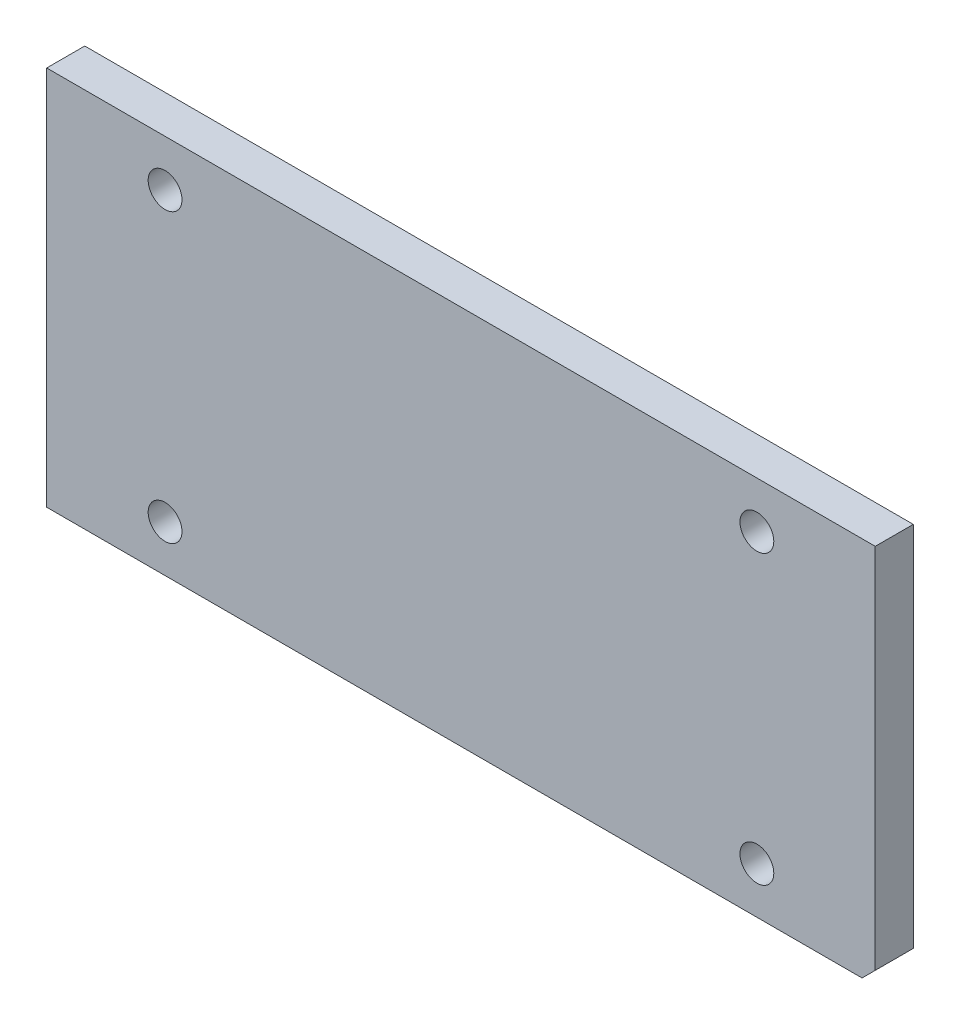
from build123d import *

# Parameters (mm, degrees)
SKETCH1_W                = 196
SKETCH1_H                = 90
BOSS_EXTRUDE1_DEPTH      = 9
TAPPED_HOLE1_D           = 6.8
TAPPED_HOLE1_DEPTH       = 11.857073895
TAPPED_HOLE1_CBORE_D     = 8
TAPPED_HOLE1_CBORE_DEPTH = 8.9
TAPPED_HOLE1_TIP         = 2.042926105
CHAMFER1_SIZE            = 3.12


with BuildPart() as part:
    # Sketch1 → Boss-Extrude1 (new body)
    with BuildSketch(Plane.XY):
        Rectangle(SKETCH1_W, SKETCH1_H)
    extrude(amount=-BOSS_EXTRUDE1_DEPTH)

    # Tapped Hole1
    with Locations(Plane(origin=(-522.991452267, 0, 0), x_dir=(1, 0, 0), z_dir=(0, 0, 1))):
        with Locations((592.991452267, 34), (592.991452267, -34), (452.991452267, -34), (452.991452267, 34)):
            CounterBoreHole(TAPPED_HOLE1_D / 2, TAPPED_HOLE1_CBORE_D / 2, TAPPED_HOLE1_CBORE_DEPTH, depth=TAPPED_HOLE1_DEPTH)
            with Locations((0, 0, -(TAPPED_HOLE1_DEPTH + TAPPED_HOLE1_TIP / 2))):  # 118° drill point
                Cone(0, TAPPED_HOLE1_D / 2, TAPPED_HOLE1_TIP, mode=Mode.SUBTRACT)

    # Chamfer1
    chamfer1_edges = [part.edges().sort_by_distance(p)[0] for p in [
        (98, -45, -4.5),
    ]]
    chamfer(chamfer1_edges, length=CHAMFER1_SIZE)


solid = part.part
